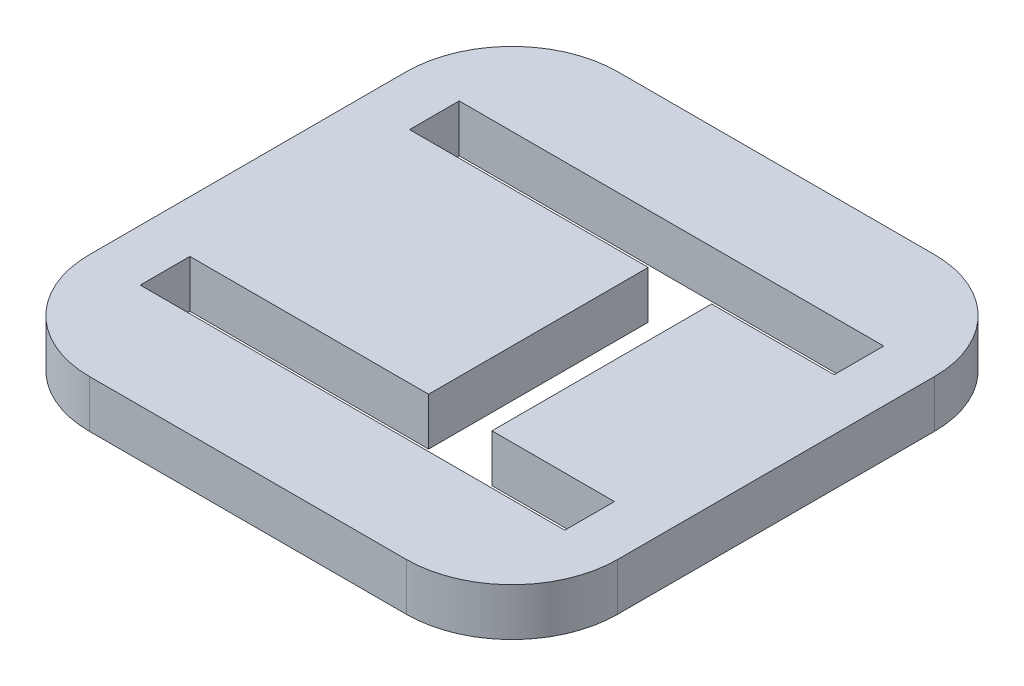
ISO-10303-21;
HEADER;
FILE_DESCRIPTION(('STEP AP214'),'2;1');
FILE_NAME('part.step','',(''),(''),'','','');
FILE_SCHEMA(('AUTOMOTIVE_DESIGN { 1 0 10303 214 1 1 1 1 }'));
ENDSEC;
DATA;
#1=APPLICATION_CONTEXT('core data for automotive mechanical design processes');
#2=APPLICATION_PROTOCOL_DEFINITION('international standard','automotive_design',2000,#1);
#3=PRODUCT_CONTEXT('',#1,'mechanical');
#4=PRODUCT('Part','Part','',(#3));
#5=PRODUCT_RELATED_PRODUCT_CATEGORY('part','',(#4));
#6=PRODUCT_DEFINITION_FORMATION('','',#4);
#7=PRODUCT_DEFINITION_CONTEXT('part definition',#1,'design');
#8=PRODUCT_DEFINITION('design','',#6,#7);
#9=PRODUCT_DEFINITION_SHAPE('','',#8);
#10=(LENGTH_UNIT() NAMED_UNIT(*) SI_UNIT(.MILLI.,.METRE.));
#11=(NAMED_UNIT(*) PLANE_ANGLE_UNIT() SI_UNIT($,.RADIAN.));
#12=(NAMED_UNIT(*) SI_UNIT($,.STERADIAN.) SOLID_ANGLE_UNIT());
#13=UNCERTAINTY_MEASURE_WITH_UNIT(LENGTH_MEASURE(1.E-05),#10,'distance_accuracy_value','');
#14=(GEOMETRIC_REPRESENTATION_CONTEXT(3) GLOBAL_UNCERTAINTY_ASSIGNED_CONTEXT((#13)) GLOBAL_UNIT_ASSIGNED_CONTEXT((#10,
#11,#12)) REPRESENTATION_CONTEXT('',''));
#15=CARTESIAN_POINT('',(0.,0.,0.));
#16=DIRECTION('',(0.,0.,1.));
#17=DIRECTION('',(1.,0.,0.));
#18=AXIS2_PLACEMENT_3D('',#15,#16,#17);
#19=CARTESIAN_POINT('',(-4.99999999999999,-9.,-30.));
#20=DIRECTION('',(0.,1.,0.));
#21=DIRECTION('',(0.,0.,1.));
#22=AXIS2_PLACEMENT_3D('',#19,#20,#21);
#23=CYLINDRICAL_SURFACE('',#22,20.);
#24=CARTESIAN_POINT('',(-4.99999999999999,0.,-30.));
#25=DIRECTION('',(0.,1.,0.));
#26=DIRECTION('',(0.,0.,-1.));
#27=AXIS2_PLACEMENT_3D('',#24,#25,#26);
#28=CIRCLE('',#27,20.);
#29=CARTESIAN_POINT('',(15.,0.,-29.9999999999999));
#30=VERTEX_POINT('',#29);
#31=CARTESIAN_POINT('',(-5.00000000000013,0.,-50.));
#32=VERTEX_POINT('',#31);
#33=EDGE_CURVE('E251',#30,#32,#28,.T.);
#34=ORIENTED_EDGE('',*,*,#33,.F.);
#35=DIRECTION('',(0.,1.,0.));
#36=VECTOR('',#35,1.);
#37=CARTESIAN_POINT('',(15.,-9.,-29.9999999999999));
#38=LINE('',#37,#36);
#39=CARTESIAN_POINT('',(15.,-9.,-29.9999999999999));
#40=VERTEX_POINT('',#39);
#41=EDGE_CURVE('E11',#40,#30,#38,.T.);
#42=ORIENTED_EDGE('',*,*,#41,.F.);
#43=CARTESIAN_POINT('',(-4.99999999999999,-9.,-30.));
#44=DIRECTION('',(0.,1.,0.));
#45=DIRECTION('',(0.,0.,-1.));
#46=AXIS2_PLACEMENT_3D('',#43,#44,#45);
#47=CIRCLE('',#46,20.);
#48=CARTESIAN_POINT('',(-5.00000000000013,-9.,-50.));
#49=VERTEX_POINT('',#48);
#50=EDGE_CURVE('E271',#40,#49,#47,.T.);
#51=ORIENTED_EDGE('',*,*,#50,.T.);
#52=DIRECTION('',(0.,1.,0.));
#53=VECTOR('',#52,1.);
#54=CARTESIAN_POINT('',(-5.00000000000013,-9.,-50.));
#55=LINE('',#54,#53);
#56=EDGE_CURVE('E36',#49,#32,#55,.T.);
#57=ORIENTED_EDGE('',*,*,#56,.T.);
#58=EDGE_LOOP('',(#34,#42,#51,#57));
#59=FACE_BOUND('',#58,.T.);
#60=ADVANCED_FACE('F33',(#59),#23,.T.);
#61=CARTESIAN_POINT('',(15.,-9.,29.9999999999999));
#62=DIRECTION('',(1.,0.,0.));
#63=DIRECTION('',(0.,0.,-1.));
#64=AXIS2_PLACEMENT_3D('',#61,#62,#63);
#65=PLANE('',#64);
#66=DIRECTION('',(0.,0.,-1.));
#67=VECTOR('',#66,1.);
#68=CARTESIAN_POINT('',(15.,0.,29.9999999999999));
#69=LINE('',#68,#67);
#70=CARTESIAN_POINT('',(15.,0.,29.9999999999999));
#71=VERTEX_POINT('',#70);
#72=EDGE_CURVE('E275',#71,#30,#69,.T.);
#73=ORIENTED_EDGE('',*,*,#72,.F.);
#74=DIRECTION('',(0.,1.,0.));
#75=VECTOR('',#74,1.);
#76=CARTESIAN_POINT('',(15.,-9.,29.9999999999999));
#77=LINE('',#76,#75);
#78=CARTESIAN_POINT('',(15.,-9.,29.9999999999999));
#79=VERTEX_POINT('',#78);
#80=EDGE_CURVE('E41',#79,#71,#77,.T.);
#81=ORIENTED_EDGE('',*,*,#80,.F.);
#82=DIRECTION('',(0.,0.,-1.));
#83=VECTOR('',#82,1.);
#84=CARTESIAN_POINT('',(15.,-9.,29.9999999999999));
#85=LINE('',#84,#83);
#86=EDGE_CURVE('E293',#79,#40,#85,.T.);
#87=ORIENTED_EDGE('',*,*,#86,.T.);
#88=ORIENTED_EDGE('',*,*,#41,.T.);
#89=EDGE_LOOP('',(#73,#81,#87,#88));
#90=FACE_BOUND('',#89,.T.);
#91=ADVANCED_FACE('F340',(#90),#65,.T.);
#92=CARTESIAN_POINT('',(-4.99999999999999,-9.,30.));
#93=DIRECTION('',(0.,1.,0.));
#94=DIRECTION('',(0.,0.,1.));
#95=AXIS2_PLACEMENT_3D('',#92,#93,#94);
#96=CYLINDRICAL_SURFACE('',#95,20.);
#97=CARTESIAN_POINT('',(-4.99999999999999,0.,30.));
#98=DIRECTION('',(0.,1.,0.));
#99=DIRECTION('',(0.,0.,1.));
#100=AXIS2_PLACEMENT_3D('',#97,#98,#99);
#101=CIRCLE('',#100,20.);
#102=CARTESIAN_POINT('',(-5.00000000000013,0.,50.));
#103=VERTEX_POINT('',#102);
#104=EDGE_CURVE('E313',#103,#71,#101,.T.);
#105=ORIENTED_EDGE('',*,*,#104,.F.);
#106=DIRECTION('',(0.,1.,0.));
#107=VECTOR('',#106,1.);
#108=CARTESIAN_POINT('',(-5.00000000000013,-9.,50.));
#109=LINE('',#108,#107);
#110=CARTESIAN_POINT('',(-5.00000000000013,-9.,50.));
#111=VERTEX_POINT('',#110);
#112=EDGE_CURVE('E319',#111,#103,#109,.T.);
#113=ORIENTED_EDGE('',*,*,#112,.F.);
#114=CARTESIAN_POINT('',(-4.99999999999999,-9.,30.));
#115=DIRECTION('',(0.,1.,0.));
#116=DIRECTION('',(0.,0.,1.));
#117=AXIS2_PLACEMENT_3D('',#114,#115,#116);
#118=CIRCLE('',#117,20.);
#119=EDGE_CURVE('E290',#111,#79,#118,.T.);
#120=ORIENTED_EDGE('',*,*,#119,.T.);
#121=ORIENTED_EDGE('',*,*,#80,.T.);
#122=EDGE_LOOP('',(#105,#113,#120,#121));
#123=FACE_BOUND('',#122,.T.);
#124=ADVANCED_FACE('F359',(#123),#96,.T.);
#125=CARTESIAN_POINT('',(-64.9999999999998,-9.,50.));
#126=DIRECTION('',(0.,0.,1.));
#127=DIRECTION('',(1.,0.,0.));
#128=AXIS2_PLACEMENT_3D('',#125,#126,#127);
#129=PLANE('',#128);
#130=DIRECTION('',(1.,0.,0.));
#131=VECTOR('',#130,1.);
#132=CARTESIAN_POINT('',(-64.9999999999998,0.,50.));
#133=LINE('',#132,#131);
#134=CARTESIAN_POINT('',(-64.9999999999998,0.,50.));
#135=VERTEX_POINT('',#134);
#136=EDGE_CURVE('E310',#135,#103,#133,.T.);
#137=ORIENTED_EDGE('',*,*,#136,.F.);
#138=DIRECTION('',(0.,1.,0.));
#139=VECTOR('',#138,1.);
#140=CARTESIAN_POINT('',(-64.9999999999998,-9.,50.));
#141=LINE('',#140,#139);
#142=CARTESIAN_POINT('',(-64.9999999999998,-9.,50.));
#143=VERTEX_POINT('',#142);
#144=EDGE_CURVE('E321',#143,#135,#141,.T.);
#145=ORIENTED_EDGE('',*,*,#144,.F.);
#146=DIRECTION('',(1.,0.,0.));
#147=VECTOR('',#146,1.);
#148=CARTESIAN_POINT('',(-64.9999999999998,-9.,50.));
#149=LINE('',#148,#147);
#150=EDGE_CURVE('E287',#143,#111,#149,.T.);
#151=ORIENTED_EDGE('',*,*,#150,.T.);
#152=ORIENTED_EDGE('',*,*,#112,.T.);
#153=EDGE_LOOP('',(#137,#145,#151,#152));
#154=FACE_BOUND('',#153,.T.);
#155=ADVANCED_FACE('F357',(#154),#129,.T.);
#156=CARTESIAN_POINT('',(-65.,-9.,30.));
#157=DIRECTION('',(0.,1.,0.));
#158=DIRECTION('',(0.,0.,1.));
#159=AXIS2_PLACEMENT_3D('',#156,#157,#158);
#160=CYLINDRICAL_SURFACE('',#159,20.);
#161=CARTESIAN_POINT('',(-65.,0.,30.));
#162=DIRECTION('',(0.,1.,0.));
#163=DIRECTION('',(0.,0.,-1.));
#164=AXIS2_PLACEMENT_3D('',#161,#162,#163);
#165=CIRCLE('',#164,20.);
#166=CARTESIAN_POINT('',(-85.,0.,29.9999999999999));
#167=VERTEX_POINT('',#166);
#168=EDGE_CURVE('E307',#167,#135,#165,.T.);
#169=ORIENTED_EDGE('',*,*,#168,.F.);
#170=DIRECTION('',(0.,1.,0.));
#171=VECTOR('',#170,1.);
#172=CARTESIAN_POINT('',(-85.,-9.,29.9999999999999));
#173=LINE('',#172,#171);
#174=CARTESIAN_POINT('',(-85.,-9.,29.9999999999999));
#175=VERTEX_POINT('',#174);
#176=EDGE_CURVE('E323',#175,#167,#173,.T.);
#177=ORIENTED_EDGE('',*,*,#176,.F.);
#178=CARTESIAN_POINT('',(-65.,-9.,30.));
#179=DIRECTION('',(0.,1.,0.));
#180=DIRECTION('',(0.,0.,-1.));
#181=AXIS2_PLACEMENT_3D('',#178,#179,#180);
#182=CIRCLE('',#181,20.);
#183=EDGE_CURVE('E284',#175,#143,#182,.T.);
#184=ORIENTED_EDGE('',*,*,#183,.T.);
#185=ORIENTED_EDGE('',*,*,#144,.T.);
#186=EDGE_LOOP('',(#169,#177,#184,#185));
#187=FACE_BOUND('',#186,.T.);
#188=ADVANCED_FACE('F353',(#187),#160,.T.);
#189=CARTESIAN_POINT('',(-85.,-9.,29.9999999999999));
#190=DIRECTION('',(-1.,0.,0.));
#191=DIRECTION('',(0.,0.,1.));
#192=AXIS2_PLACEMENT_3D('',#189,#190,#191);
#193=PLANE('',#192);
#194=DIRECTION('',(0.,0.,1.));
#195=VECTOR('',#194,1.);
#196=CARTESIAN_POINT('',(-85.,0.,29.9999999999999));
#197=LINE('',#196,#195);
#198=CARTESIAN_POINT('',(-85.,0.,-29.9999999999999));
#199=VERTEX_POINT('',#198);
#200=EDGE_CURVE('E304',#199,#167,#197,.T.);
#201=ORIENTED_EDGE('',*,*,#200,.F.);
#202=DIRECTION('',(0.,1.,0.));
#203=VECTOR('',#202,1.);
#204=CARTESIAN_POINT('',(-85.,-9.,-29.9999999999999));
#205=LINE('',#204,#203);
#206=CARTESIAN_POINT('',(-85.,-9.,-29.9999999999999));
#207=VERTEX_POINT('',#206);
#208=EDGE_CURVE('E325',#207,#199,#205,.T.);
#209=ORIENTED_EDGE('',*,*,#208,.F.);
#210=DIRECTION('',(0.,0.,1.));
#211=VECTOR('',#210,1.);
#212=CARTESIAN_POINT('',(-85.,-9.,29.9999999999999));
#213=LINE('',#212,#211);
#214=EDGE_CURVE('E281',#207,#175,#213,.T.);
#215=ORIENTED_EDGE('',*,*,#214,.T.);
#216=ORIENTED_EDGE('',*,*,#176,.T.);
#217=EDGE_LOOP('',(#201,#209,#215,#216));
#218=FACE_BOUND('',#217,.T.);
#219=ADVANCED_FACE('F351',(#218),#193,.T.);
#220=CARTESIAN_POINT('',(-65.,-9.,-30.));
#221=DIRECTION('',(0.,1.,0.));
#222=DIRECTION('',(0.,0.,1.));
#223=AXIS2_PLACEMENT_3D('',#220,#221,#222);
#224=CYLINDRICAL_SURFACE('',#223,20.);
#225=CARTESIAN_POINT('',(-65.,0.,-30.));
#226=DIRECTION('',(0.,1.,0.));
#227=DIRECTION('',(0.,0.,-1.));
#228=AXIS2_PLACEMENT_3D('',#225,#226,#227);
#229=CIRCLE('',#228,20.);
#230=CARTESIAN_POINT('',(-64.9999999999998,0.,-50.));
#231=VERTEX_POINT('',#230);
#232=EDGE_CURVE('E301',#231,#199,#229,.T.);
#233=ORIENTED_EDGE('',*,*,#232,.F.);
#234=DIRECTION('',(0.,1.,0.));
#235=VECTOR('',#234,1.);
#236=CARTESIAN_POINT('',(-64.9999999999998,-9.,-50.));
#237=LINE('',#236,#235);
#238=CARTESIAN_POINT('',(-64.9999999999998,-9.,-50.));
#239=VERTEX_POINT('',#238);
#240=EDGE_CURVE('E326',#239,#231,#237,.T.);
#241=ORIENTED_EDGE('',*,*,#240,.F.);
#242=CARTESIAN_POINT('',(-65.,-9.,-30.));
#243=DIRECTION('',(0.,1.,0.));
#244=DIRECTION('',(0.,0.,-1.));
#245=AXIS2_PLACEMENT_3D('',#242,#243,#244);
#246=CIRCLE('',#245,20.);
#247=EDGE_CURVE('E278',#239,#207,#246,.T.);
#248=ORIENTED_EDGE('',*,*,#247,.T.);
#249=ORIENTED_EDGE('',*,*,#208,.T.);
#250=EDGE_LOOP('',(#233,#241,#248,#249));
#251=FACE_BOUND('',#250,.T.);
#252=ADVANCED_FACE('F347',(#251),#224,.T.);
#253=CARTESIAN_POINT('',(-64.9999999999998,-9.,-50.));
#254=DIRECTION('',(0.,0.,-1.));
#255=DIRECTION('',(-1.,0.,0.));
#256=AXIS2_PLACEMENT_3D('',#253,#254,#255);
#257=PLANE('',#256);
#258=DIRECTION('',(-1.,0.,0.));
#259=VECTOR('',#258,1.);
#260=CARTESIAN_POINT('',(-64.9999999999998,0.,-50.));
#261=LINE('',#260,#259);
#262=EDGE_CURVE('E298',#32,#231,#261,.T.);
#263=ORIENTED_EDGE('',*,*,#262,.F.);
#264=ORIENTED_EDGE('',*,*,#56,.F.);
#265=DIRECTION('',(-1.,0.,0.));
#266=VECTOR('',#265,1.);
#267=CARTESIAN_POINT('',(-64.9999999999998,-9.,-50.));
#268=LINE('',#267,#266);
#269=EDGE_CURVE('E274',#49,#239,#268,.T.);
#270=ORIENTED_EDGE('',*,*,#269,.T.);
#271=ORIENTED_EDGE('',*,*,#240,.T.);
#272=EDGE_LOOP('',(#263,#264,#270,#271));
#273=FACE_BOUND('',#272,.T.);
#274=ADVANCED_FACE('F334',(#273),#257,.T.);
#275=CARTESIAN_POINT('',(-4.99999999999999,-9.,-30.));
#276=DIRECTION('',(0.,-1.,0.));
#277=DIRECTION('',(0.,0.,-1.));
#278=AXIS2_PLACEMENT_3D('',#275,#276,#277);
#279=PLANE('',#278);
#280=DIRECTION('',(0.,0.,1.));
#281=VECTOR('',#280,1.);
#282=CARTESIAN_POINT('',(-75.2,-9.,30.2));
#283=LINE('',#282,#281);
#284=CARTESIAN_POINT('',(-75.2,-9.,20.8));
#285=VERTEX_POINT('',#284);
#286=CARTESIAN_POINT('',(-75.2,-9.,30.2));
#287=VERTEX_POINT('',#286);
#288=EDGE_CURVE('E172',#285,#287,#283,.T.);
#289=ORIENTED_EDGE('',*,*,#288,.T.);
#290=DIRECTION('',(1.,0.,0.));
#291=VECTOR('',#290,1.);
#292=CARTESIAN_POINT('',(-75.2,-9.,30.2));
#293=LINE('',#292,#291);
#294=CARTESIAN_POINT('',(5.20000000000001,-9.,30.2));
#295=VERTEX_POINT('',#294);
#296=EDGE_CURVE('E181',#287,#295,#293,.T.);
#297=ORIENTED_EDGE('',*,*,#296,.T.);
#298=DIRECTION('',(0.,0.,-1.));
#299=VECTOR('',#298,1.);
#300=CARTESIAN_POINT('',(5.20000000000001,-9.,30.2));
#301=LINE('',#300,#299);
#302=CARTESIAN_POINT('',(5.20000000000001,-9.,20.8));
#303=VERTEX_POINT('',#302);
#304=EDGE_CURVE('E49',#295,#303,#301,.T.);
#305=ORIENTED_EDGE('',*,*,#304,.T.);
#306=DIRECTION('',(-1.,0.,0.));
#307=VECTOR('',#306,1.);
#308=CARTESIAN_POINT('',(-18.,-9.,20.8));
#309=LINE('',#308,#307);
#310=CARTESIAN_POINT('',(-18.,-9.,20.8));
#311=VERTEX_POINT('',#310);
#312=EDGE_CURVE('E196',#303,#311,#309,.T.);
#313=ORIENTED_EDGE('',*,*,#312,.T.);
#314=DIRECTION('',(0.,0.,-1.));
#315=VECTOR('',#314,1.);
#316=CARTESIAN_POINT('',(-18.,-9.,20.8));
#317=LINE('',#316,#315);
#318=CARTESIAN_POINT('',(-18.,-9.,-20.8));
#319=VERTEX_POINT('',#318);
#320=EDGE_CURVE('E199',#311,#319,#317,.T.);
#321=ORIENTED_EDGE('',*,*,#320,.T.);
#322=DIRECTION('',(1.,0.,0.));
#323=VECTOR('',#322,1.);
#324=CARTESIAN_POINT('',(5.20000000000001,-9.,-20.8));
#325=LINE('',#324,#323);
#326=CARTESIAN_POINT('',(5.20000000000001,-9.,-20.8));
#327=VERTEX_POINT('',#326);
#328=EDGE_CURVE('E202',#319,#327,#325,.T.);
#329=ORIENTED_EDGE('',*,*,#328,.T.);
#330=DIRECTION('',(0.,0.,-1.));
#331=VECTOR('',#330,1.);
#332=CARTESIAN_POINT('',(5.20000000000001,-9.,-20.8));
#333=LINE('',#332,#331);
#334=CARTESIAN_POINT('',(5.20000000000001,-9.,-30.2));
#335=VERTEX_POINT('',#334);
#336=EDGE_CURVE('E205',#327,#335,#333,.T.);
#337=ORIENTED_EDGE('',*,*,#336,.T.);
#338=DIRECTION('',(-1.,0.,0.));
#339=VECTOR('',#338,1.);
#340=CARTESIAN_POINT('',(5.20000000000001,-9.,-30.2));
#341=LINE('',#340,#339);
#342=CARTESIAN_POINT('',(-75.2,-9.,-30.2));
#343=VERTEX_POINT('',#342);
#344=EDGE_CURVE('E208',#335,#343,#341,.T.);
#345=ORIENTED_EDGE('',*,*,#344,.T.);
#346=DIRECTION('',(0.,0.,1.));
#347=VECTOR('',#346,1.);
#348=CARTESIAN_POINT('',(-75.2,-9.,-20.8));
#349=LINE('',#348,#347);
#350=CARTESIAN_POINT('',(-75.2,-9.,-20.8));
#351=VERTEX_POINT('',#350);
#352=EDGE_CURVE('E211',#343,#351,#349,.T.);
#353=ORIENTED_EDGE('',*,*,#352,.T.);
#354=DIRECTION('',(1.,0.,0.));
#355=VECTOR('',#354,1.);
#356=CARTESIAN_POINT('',(-30.,-9.,-20.8));
#357=LINE('',#356,#355);
#358=CARTESIAN_POINT('',(-30.,-9.,-20.8));
#359=VERTEX_POINT('',#358);
#360=EDGE_CURVE('E214',#351,#359,#357,.T.);
#361=ORIENTED_EDGE('',*,*,#360,.T.);
#362=DIRECTION('',(0.,0.,1.));
#363=VECTOR('',#362,1.);
#364=CARTESIAN_POINT('',(-30.,-9.,20.8));
#365=LINE('',#364,#363);
#366=CARTESIAN_POINT('',(-30.,-9.,20.8));
#367=VERTEX_POINT('',#366);
#368=EDGE_CURVE('E217',#359,#367,#365,.T.);
#369=ORIENTED_EDGE('',*,*,#368,.T.);
#370=DIRECTION('',(-1.,0.,0.));
#371=VECTOR('',#370,1.);
#372=CARTESIAN_POINT('',(-75.2,-9.,20.8));
#373=LINE('',#372,#371);
#374=EDGE_CURVE('E178',#367,#285,#373,.T.);
#375=ORIENTED_EDGE('',*,*,#374,.T.);
#376=EDGE_LOOP('',(#289,#297,#305,#313,#321,#329,#337,#345,#353,#361,#369,#375));
#377=FACE_BOUND('',#376,.T.);
#378=ORIENTED_EDGE('',*,*,#50,.F.);
#379=ORIENTED_EDGE('',*,*,#86,.F.);
#380=ORIENTED_EDGE('',*,*,#119,.F.);
#381=ORIENTED_EDGE('',*,*,#150,.F.);
#382=ORIENTED_EDGE('',*,*,#183,.F.);
#383=ORIENTED_EDGE('',*,*,#214,.F.);
#384=ORIENTED_EDGE('',*,*,#247,.F.);
#385=ORIENTED_EDGE('',*,*,#269,.F.);
#386=EDGE_LOOP('',(#378,#379,#380,#381,#382,#383,#384,#385));
#387=FACE_BOUND('',#386,.T.);
#388=ADVANCED_FACE('F185',(#377,#387),#279,.T.);
#389=CARTESIAN_POINT('',(-4.99999999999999,0.,-30.));
#390=DIRECTION('',(0.,-1.,0.));
#391=DIRECTION('',(0.,0.,-1.));
#392=AXIS2_PLACEMENT_3D('',#389,#390,#391);
#393=PLANE('',#392);
#394=DIRECTION('',(1.,0.,0.));
#395=VECTOR('',#394,1.);
#396=CARTESIAN_POINT('',(-75.2,0.,30.2));
#397=LINE('',#396,#395);
#398=CARTESIAN_POINT('',(-75.2,0.,30.2));
#399=VERTEX_POINT('',#398);
#400=CARTESIAN_POINT('',(5.20000000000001,0.,30.2));
#401=VERTEX_POINT('',#400);
#402=EDGE_CURVE('E221',#399,#401,#397,.T.);
#403=ORIENTED_EDGE('',*,*,#402,.F.);
#404=DIRECTION('',(0.,0.,1.));
#405=VECTOR('',#404,1.);
#406=CARTESIAN_POINT('',(-75.2,0.,30.2));
#407=LINE('',#406,#405);
#408=CARTESIAN_POINT('',(-75.2,0.,20.8));
#409=VERTEX_POINT('',#408);
#410=EDGE_CURVE('E57',#409,#399,#407,.T.);
#411=ORIENTED_EDGE('',*,*,#410,.F.);
#412=DIRECTION('',(-1.,0.,0.));
#413=VECTOR('',#412,1.);
#414=CARTESIAN_POINT('',(-75.2,0.,20.8));
#415=LINE('',#414,#413);
#416=CARTESIAN_POINT('',(-30.,0.,20.8));
#417=VERTEX_POINT('',#416);
#418=EDGE_CURVE('E189',#417,#409,#415,.T.);
#419=ORIENTED_EDGE('',*,*,#418,.F.);
#420=DIRECTION('',(0.,0.,1.));
#421=VECTOR('',#420,1.);
#422=CARTESIAN_POINT('',(-30.,0.,20.8));
#423=LINE('',#422,#421);
#424=CARTESIAN_POINT('',(-30.,0.,-20.8));
#425=VERTEX_POINT('',#424);
#426=EDGE_CURVE('E192',#425,#417,#423,.T.);
#427=ORIENTED_EDGE('',*,*,#426,.F.);
#428=DIRECTION('',(1.,0.,0.));
#429=VECTOR('',#428,1.);
#430=CARTESIAN_POINT('',(-30.,0.,-20.8));
#431=LINE('',#430,#429);
#432=CARTESIAN_POINT('',(-75.2,0.,-20.8));
#433=VERTEX_POINT('',#432);
#434=EDGE_CURVE('E244',#433,#425,#431,.T.);
#435=ORIENTED_EDGE('',*,*,#434,.F.);
#436=DIRECTION('',(0.,0.,1.));
#437=VECTOR('',#436,1.);
#438=CARTESIAN_POINT('',(-75.2,0.,-20.8));
#439=LINE('',#438,#437);
#440=CARTESIAN_POINT('',(-75.2,0.,-30.2));
#441=VERTEX_POINT('',#440);
#442=EDGE_CURVE('E241',#441,#433,#439,.T.);
#443=ORIENTED_EDGE('',*,*,#442,.F.);
#444=DIRECTION('',(-1.,0.,0.));
#445=VECTOR('',#444,1.);
#446=CARTESIAN_POINT('',(5.20000000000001,0.,-30.2));
#447=LINE('',#446,#445);
#448=CARTESIAN_POINT('',(5.20000000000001,0.,-30.2));
#449=VERTEX_POINT('',#448);
#450=EDGE_CURVE('E238',#449,#441,#447,.T.);
#451=ORIENTED_EDGE('',*,*,#450,.F.);
#452=DIRECTION('',(0.,0.,-1.));
#453=VECTOR('',#452,1.);
#454=CARTESIAN_POINT('',(5.20000000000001,0.,-20.8));
#455=LINE('',#454,#453);
#456=CARTESIAN_POINT('',(5.20000000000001,0.,-20.8));
#457=VERTEX_POINT('',#456);
#458=EDGE_CURVE('E235',#457,#449,#455,.T.);
#459=ORIENTED_EDGE('',*,*,#458,.F.);
#460=DIRECTION('',(1.,0.,0.));
#461=VECTOR('',#460,1.);
#462=CARTESIAN_POINT('',(5.20000000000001,0.,-20.8));
#463=LINE('',#462,#461);
#464=CARTESIAN_POINT('',(-18.,0.,-20.8));
#465=VERTEX_POINT('',#464);
#466=EDGE_CURVE('E232',#465,#457,#463,.T.);
#467=ORIENTED_EDGE('',*,*,#466,.F.);
#468=DIRECTION('',(0.,0.,-1.));
#469=VECTOR('',#468,1.);
#470=CARTESIAN_POINT('',(-18.,0.,20.8));
#471=LINE('',#470,#469);
#472=CARTESIAN_POINT('',(-18.,0.,20.8));
#473=VERTEX_POINT('',#472);
#474=EDGE_CURVE('E229',#473,#465,#471,.T.);
#475=ORIENTED_EDGE('',*,*,#474,.F.);
#476=DIRECTION('',(-1.,0.,0.));
#477=VECTOR('',#476,1.);
#478=CARTESIAN_POINT('',(-18.,0.,20.8));
#479=LINE('',#478,#477);
#480=CARTESIAN_POINT('',(5.20000000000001,0.,20.8));
#481=VERTEX_POINT('',#480);
#482=EDGE_CURVE('E226',#481,#473,#479,.T.);
#483=ORIENTED_EDGE('',*,*,#482,.F.);
#484=DIRECTION('',(0.,0.,-1.));
#485=VECTOR('',#484,1.);
#486=CARTESIAN_POINT('',(5.20000000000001,0.,30.2));
#487=LINE('',#486,#485);
#488=EDGE_CURVE('E223',#401,#481,#487,.T.);
#489=ORIENTED_EDGE('',*,*,#488,.F.);
#490=EDGE_LOOP('',(#403,#411,#419,#427,#435,#443,#451,#459,#467,#475,#483,#489));
#491=FACE_BOUND('',#490,.T.);
#492=ORIENTED_EDGE('',*,*,#33,.T.);
#493=ORIENTED_EDGE('',*,*,#262,.T.);
#494=ORIENTED_EDGE('',*,*,#232,.T.);
#495=ORIENTED_EDGE('',*,*,#200,.T.);
#496=ORIENTED_EDGE('',*,*,#168,.T.);
#497=ORIENTED_EDGE('',*,*,#136,.T.);
#498=ORIENTED_EDGE('',*,*,#104,.T.);
#499=ORIENTED_EDGE('',*,*,#72,.T.);
#500=EDGE_LOOP('',(#492,#493,#494,#495,#496,#497,#498,#499));
#501=FACE_BOUND('',#500,.T.);
#502=ADVANCED_FACE('F336',(#491,#501),#393,.F.);
#503=CARTESIAN_POINT('',(-75.2,-9.,30.2));
#504=DIRECTION('',(-1.,0.,0.));
#505=DIRECTION('',(0.,0.,1.));
#506=AXIS2_PLACEMENT_3D('',#503,#504,#505);
#507=PLANE('',#506);
#508=ORIENTED_EDGE('',*,*,#410,.T.);
#509=DIRECTION('',(0.,1.,0.));
#510=VECTOR('',#509,1.);
#511=CARTESIAN_POINT('',(-75.2,-9.,30.2));
#512=LINE('',#511,#510);
#513=EDGE_CURVE('E168',#287,#399,#512,.T.);
#514=ORIENTED_EDGE('',*,*,#513,.F.);
#515=ORIENTED_EDGE('',*,*,#288,.F.);
#516=DIRECTION('',(0.,1.,0.));
#517=VECTOR('',#516,1.);
#518=CARTESIAN_POINT('',(-75.2,-9.,20.8));
#519=LINE('',#518,#517);
#520=EDGE_CURVE('E249',#285,#409,#519,.T.);
#521=ORIENTED_EDGE('',*,*,#520,.T.);
#522=EDGE_LOOP('',(#508,#514,#515,#521));
#523=FACE_BOUND('',#522,.T.);
#524=ADVANCED_FACE('F170',(#523),#507,.F.);
#525=CARTESIAN_POINT('',(-75.2,-9.,20.8));
#526=DIRECTION('',(0.,0.,-1.));
#527=DIRECTION('',(-1.,0.,0.));
#528=AXIS2_PLACEMENT_3D('',#525,#526,#527);
#529=PLANE('',#528);
#530=ORIENTED_EDGE('',*,*,#418,.T.);
#531=ORIENTED_EDGE('',*,*,#520,.F.);
#532=ORIENTED_EDGE('',*,*,#374,.F.);
#533=DIRECTION('',(0.,1.,0.));
#534=VECTOR('',#533,1.);
#535=CARTESIAN_POINT('',(-30.,-9.,20.8));
#536=LINE('',#535,#534);
#537=EDGE_CURVE('E252',#367,#417,#536,.T.);
#538=ORIENTED_EDGE('',*,*,#537,.T.);
#539=EDGE_LOOP('',(#530,#531,#532,#538));
#540=FACE_BOUND('',#539,.T.);
#541=ADVANCED_FACE('F442',(#540),#529,.F.);
#542=CARTESIAN_POINT('',(-30.,-9.,20.8));
#543=DIRECTION('',(-1.,0.,0.));
#544=DIRECTION('',(0.,0.,1.));
#545=AXIS2_PLACEMENT_3D('',#542,#543,#544);
#546=PLANE('',#545);
#547=ORIENTED_EDGE('',*,*,#426,.T.);
#548=ORIENTED_EDGE('',*,*,#537,.F.);
#549=ORIENTED_EDGE('',*,*,#368,.F.);
#550=DIRECTION('',(0.,1.,0.));
#551=VECTOR('',#550,1.);
#552=CARTESIAN_POINT('',(-30.,-9.,-20.8));
#553=LINE('',#552,#551);
#554=EDGE_CURVE('E254',#359,#425,#553,.T.);
#555=ORIENTED_EDGE('',*,*,#554,.T.);
#556=EDGE_LOOP('',(#547,#548,#549,#555));
#557=FACE_BOUND('',#556,.T.);
#558=ADVANCED_FACE('F451',(#557),#546,.F.);
#559=CARTESIAN_POINT('',(-30.,-9.,-20.8));
#560=DIRECTION('',(0.,0.,1.));
#561=DIRECTION('',(1.,0.,0.));
#562=AXIS2_PLACEMENT_3D('',#559,#560,#561);
#563=PLANE('',#562);
#564=ORIENTED_EDGE('',*,*,#434,.T.);
#565=ORIENTED_EDGE('',*,*,#554,.F.);
#566=ORIENTED_EDGE('',*,*,#360,.F.);
#567=DIRECTION('',(0.,1.,0.));
#568=VECTOR('',#567,1.);
#569=CARTESIAN_POINT('',(-75.2,-9.,-20.8));
#570=LINE('',#569,#568);
#571=EDGE_CURVE('E256',#351,#433,#570,.T.);
#572=ORIENTED_EDGE('',*,*,#571,.T.);
#573=EDGE_LOOP('',(#564,#565,#566,#572));
#574=FACE_BOUND('',#573,.T.);
#575=ADVANCED_FACE('F461',(#574),#563,.F.);
#576=CARTESIAN_POINT('',(-75.2,-9.,-20.8));
#577=DIRECTION('',(-1.,0.,0.));
#578=DIRECTION('',(0.,0.,1.));
#579=AXIS2_PLACEMENT_3D('',#576,#577,#578);
#580=PLANE('',#579);
#581=ORIENTED_EDGE('',*,*,#442,.T.);
#582=ORIENTED_EDGE('',*,*,#571,.F.);
#583=ORIENTED_EDGE('',*,*,#352,.F.);
#584=DIRECTION('',(0.,1.,0.));
#585=VECTOR('',#584,1.);
#586=CARTESIAN_POINT('',(-75.2,-9.,-30.2));
#587=LINE('',#586,#585);
#588=EDGE_CURVE('E258',#343,#441,#587,.T.);
#589=ORIENTED_EDGE('',*,*,#588,.T.);
#590=EDGE_LOOP('',(#581,#582,#583,#589));
#591=FACE_BOUND('',#590,.T.);
#592=ADVANCED_FACE('F471',(#591),#580,.F.);
#593=CARTESIAN_POINT('',(5.20000000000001,-9.,-30.2));
#594=DIRECTION('',(0.,0.,-1.));
#595=DIRECTION('',(-1.,0.,0.));
#596=AXIS2_PLACEMENT_3D('',#593,#594,#595);
#597=PLANE('',#596);
#598=ORIENTED_EDGE('',*,*,#450,.T.);
#599=ORIENTED_EDGE('',*,*,#588,.F.);
#600=ORIENTED_EDGE('',*,*,#344,.F.);
#601=DIRECTION('',(0.,1.,0.));
#602=VECTOR('',#601,1.);
#603=CARTESIAN_POINT('',(5.20000000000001,-9.,-30.2));
#604=LINE('',#603,#602);
#605=EDGE_CURVE('E260',#335,#449,#604,.T.);
#606=ORIENTED_EDGE('',*,*,#605,.T.);
#607=EDGE_LOOP('',(#598,#599,#600,#606));
#608=FACE_BOUND('',#607,.T.);
#609=ADVANCED_FACE('F481',(#608),#597,.F.);
#610=CARTESIAN_POINT('',(5.20000000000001,-9.,-20.8));
#611=DIRECTION('',(1.,0.,0.));
#612=DIRECTION('',(0.,0.,-1.));
#613=AXIS2_PLACEMENT_3D('',#610,#611,#612);
#614=PLANE('',#613);
#615=ORIENTED_EDGE('',*,*,#458,.T.);
#616=ORIENTED_EDGE('',*,*,#605,.F.);
#617=ORIENTED_EDGE('',*,*,#336,.F.);
#618=DIRECTION('',(0.,1.,0.));
#619=VECTOR('',#618,1.);
#620=CARTESIAN_POINT('',(5.20000000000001,-9.,-20.8));
#621=LINE('',#620,#619);
#622=EDGE_CURVE('E262',#327,#457,#621,.T.);
#623=ORIENTED_EDGE('',*,*,#622,.T.);
#624=EDGE_LOOP('',(#615,#616,#617,#623));
#625=FACE_BOUND('',#624,.T.);
#626=ADVANCED_FACE('F491',(#625),#614,.F.);
#627=CARTESIAN_POINT('',(5.20000000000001,-9.,-20.8));
#628=DIRECTION('',(0.,0.,1.));
#629=DIRECTION('',(1.,0.,0.));
#630=AXIS2_PLACEMENT_3D('',#627,#628,#629);
#631=PLANE('',#630);
#632=ORIENTED_EDGE('',*,*,#466,.T.);
#633=ORIENTED_EDGE('',*,*,#622,.F.);
#634=ORIENTED_EDGE('',*,*,#328,.F.);
#635=DIRECTION('',(0.,1.,0.));
#636=VECTOR('',#635,1.);
#637=CARTESIAN_POINT('',(-18.,-9.,-20.8));
#638=LINE('',#637,#636);
#639=EDGE_CURVE('E264',#319,#465,#638,.T.);
#640=ORIENTED_EDGE('',*,*,#639,.T.);
#641=EDGE_LOOP('',(#632,#633,#634,#640));
#642=FACE_BOUND('',#641,.T.);
#643=ADVANCED_FACE('F501',(#642),#631,.F.);
#644=CARTESIAN_POINT('',(-18.,-9.,20.8));
#645=DIRECTION('',(1.,0.,0.));
#646=DIRECTION('',(0.,0.,-1.));
#647=AXIS2_PLACEMENT_3D('',#644,#645,#646);
#648=PLANE('',#647);
#649=ORIENTED_EDGE('',*,*,#474,.T.);
#650=ORIENTED_EDGE('',*,*,#639,.F.);
#651=ORIENTED_EDGE('',*,*,#320,.F.);
#652=DIRECTION('',(0.,1.,0.));
#653=VECTOR('',#652,1.);
#654=CARTESIAN_POINT('',(-18.,-9.,20.8));
#655=LINE('',#654,#653);
#656=EDGE_CURVE('E266',#311,#473,#655,.T.);
#657=ORIENTED_EDGE('',*,*,#656,.T.);
#658=EDGE_LOOP('',(#649,#650,#651,#657));
#659=FACE_BOUND('',#658,.T.);
#660=ADVANCED_FACE('F511',(#659),#648,.F.);
#661=CARTESIAN_POINT('',(-18.,-9.,20.8));
#662=DIRECTION('',(0.,0.,-1.));
#663=DIRECTION('',(-1.,0.,0.));
#664=AXIS2_PLACEMENT_3D('',#661,#662,#663);
#665=PLANE('',#664);
#666=ORIENTED_EDGE('',*,*,#482,.T.);
#667=ORIENTED_EDGE('',*,*,#656,.F.);
#668=ORIENTED_EDGE('',*,*,#312,.F.);
#669=DIRECTION('',(0.,1.,0.));
#670=VECTOR('',#669,1.);
#671=CARTESIAN_POINT('',(5.20000000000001,-9.,20.8));
#672=LINE('',#671,#670);
#673=EDGE_CURVE('E268',#303,#481,#672,.T.);
#674=ORIENTED_EDGE('',*,*,#673,.T.);
#675=EDGE_LOOP('',(#666,#667,#668,#674));
#676=FACE_BOUND('',#675,.T.);
#677=ADVANCED_FACE('F521',(#676),#665,.F.);
#678=CARTESIAN_POINT('',(5.20000000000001,-9.,30.2));
#679=DIRECTION('',(1.,0.,0.));
#680=DIRECTION('',(0.,0.,-1.));
#681=AXIS2_PLACEMENT_3D('',#678,#679,#680);
#682=PLANE('',#681);
#683=ORIENTED_EDGE('',*,*,#488,.T.);
#684=ORIENTED_EDGE('',*,*,#673,.F.);
#685=ORIENTED_EDGE('',*,*,#304,.F.);
#686=DIRECTION('',(0.,1.,0.));
#687=VECTOR('',#686,1.);
#688=CARTESIAN_POINT('',(5.20000000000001,-9.,30.2));
#689=LINE('',#688,#687);
#690=EDGE_CURVE('E177',#295,#401,#689,.T.);
#691=ORIENTED_EDGE('',*,*,#690,.T.);
#692=EDGE_LOOP('',(#683,#684,#685,#691));
#693=FACE_BOUND('',#692,.T.);
#694=ADVANCED_FACE('F531',(#693),#682,.F.);
#695=CARTESIAN_POINT('',(-75.2,-9.,30.2));
#696=DIRECTION('',(0.,0.,1.));
#697=DIRECTION('',(1.,0.,0.));
#698=AXIS2_PLACEMENT_3D('',#695,#696,#697);
#699=PLANE('',#698);
#700=ORIENTED_EDGE('',*,*,#402,.T.);
#701=ORIENTED_EDGE('',*,*,#690,.F.);
#702=ORIENTED_EDGE('',*,*,#296,.F.);
#703=ORIENTED_EDGE('',*,*,#513,.T.);
#704=EDGE_LOOP('',(#700,#701,#702,#703));
#705=FACE_BOUND('',#704,.T.);
#706=ADVANCED_FACE('F182',(#705),#699,.F.);
#707=CLOSED_SHELL('',(#60,#91,#124,#155,#188,#219,#252,#274,#388,#502,#524,#541,#558,#575,#592,
#609,#626,#643,#660,#677,#694,#706));
#708=MANIFOLD_SOLID_BREP('B2',#707);
#709=ADVANCED_BREP_SHAPE_REPRESENTATION('',(#18,#708),#14);
#710=SHAPE_DEFINITION_REPRESENTATION(#9,#709);
ENDSEC;
END-ISO-10303-21;
